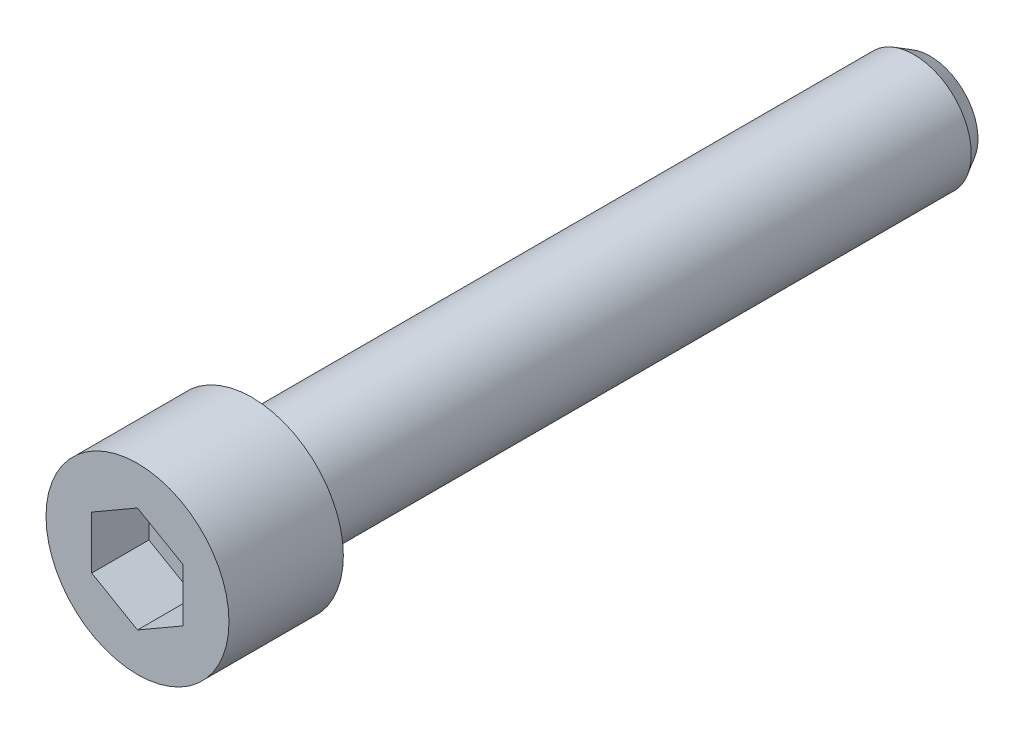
ISO-10303-21;
HEADER;
FILE_DESCRIPTION(('STEP AP214'),'2;1');
FILE_NAME('part.step','',(''),(''),'','','');
FILE_SCHEMA(('AUTOMOTIVE_DESIGN { 1 0 10303 214 1 1 1 1 }'));
ENDSEC;
DATA;
#1=APPLICATION_CONTEXT('core data for automotive mechanical design processes');
#2=APPLICATION_PROTOCOL_DEFINITION('international standard','automotive_design',2000,#1);
#3=PRODUCT_CONTEXT('',#1,'mechanical');
#4=PRODUCT('Part','Part','',(#3));
#5=PRODUCT_RELATED_PRODUCT_CATEGORY('part','',(#4));
#6=PRODUCT_DEFINITION_FORMATION('','',#4);
#7=PRODUCT_DEFINITION_CONTEXT('part definition',#1,'design');
#8=PRODUCT_DEFINITION('design','',#6,#7);
#9=PRODUCT_DEFINITION_SHAPE('','',#8);
#10=(LENGTH_UNIT() NAMED_UNIT(*) SI_UNIT(.MILLI.,.METRE.));
#11=(NAMED_UNIT(*) PLANE_ANGLE_UNIT() SI_UNIT($,.RADIAN.));
#12=(NAMED_UNIT(*) SI_UNIT($,.STERADIAN.) SOLID_ANGLE_UNIT());
#13=UNCERTAINTY_MEASURE_WITH_UNIT(LENGTH_MEASURE(1.E-05),#10,'distance_accuracy_value','');
#14=(GEOMETRIC_REPRESENTATION_CONTEXT(3) GLOBAL_UNCERTAINTY_ASSIGNED_CONTEXT((#13)) GLOBAL_UNIT_ASSIGNED_CONTEXT((#10,
#11,#12)) REPRESENTATION_CONTEXT('',''));
#15=CARTESIAN_POINT('',(0.,0.,0.));
#16=DIRECTION('',(0.,0.,1.));
#17=DIRECTION('',(1.,0.,0.));
#18=AXIS2_PLACEMENT_3D('',#15,#16,#17);
#19=CARTESIAN_POINT('',(0.,0.,1.8));
#20=DIRECTION('',(0.,0.,-1.));
#21=DIRECTION('',(1.,0.,0.));
#22=AXIS2_PLACEMENT_3D('',#19,#20,#21);
#23=SPHERICAL_SURFACE('',#22,3.5);
#24=CARTESIAN_POINT('',(0.,0.,0.7));
#25=DIRECTION('',(0.,0.,-1.));
#26=DIRECTION('',(1.,0.,0.));
#27=AXIS2_PLACEMENT_3D('',#24,#25,#26);
#28=CIRCLE('',#27,3.32264954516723);
#29=CARTESIAN_POINT('',(3.32264954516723,0.,0.7));
#30=VERTEX_POINT('',#29);
#31=EDGE_CURVE('E9',#30,#30,#28,.T.);
#32=CARTESIAN_POINT('',(0.,0.,0.));
#33=DIRECTION('',(0.,0.,-1.));
#34=DIRECTION('',(1.,0.,0.));
#35=AXIS2_PLACEMENT_3D('',#32,#33,#34);
#36=CIRCLE('',#35,3.00166620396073);
#37=CARTESIAN_POINT('',(3.00166620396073,0.,0.));
#38=VERTEX_POINT('',#37);
#39=EDGE_CURVE('E17',#38,#38,#36,.F.);
#40=CARTESIAN_POINT('',(3.32264954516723,0.,0.7));
#41=CARTESIAN_POINT('',(3.32012332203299,0.,0.692369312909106));
#42=CARTESIAN_POINT('',(3.31757081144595,0.,0.68474732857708));
#43=CARTESIAN_POINT('',(3.31241333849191,0.,0.669521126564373));
#44=CARTESIAN_POINT('',(3.30980837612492,0.,0.661916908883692));
#45=CARTESIAN_POINT('',(3.30454612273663,0.,0.646726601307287));
#46=CARTESIAN_POINT('',(3.30188883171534,0.,0.639140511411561));
#47=CARTESIAN_POINT('',(3.29652204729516,0.,0.623986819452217));
#48=CARTESIAN_POINT('',(3.29381255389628,0.,0.616419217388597));
#49=CARTESIAN_POINT('',(3.28834149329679,0.,0.601302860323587));
#50=CARTESIAN_POINT('',(3.28557992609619,0.,0.593754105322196));
#51=CARTESIAN_POINT('',(3.28000484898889,0.,0.578675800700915));
#52=CARTESIAN_POINT('',(3.27719133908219,0.,0.571146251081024));
#53=CARTESIAN_POINT('',(3.27151251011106,0.,0.556106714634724));
#54=CARTESIAN_POINT('',(3.26864719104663,0.,0.548596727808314));
#55=CARTESIAN_POINT('',(3.26286487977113,0.,0.533596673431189));
#56=CARTESIAN_POINT('',(3.25994788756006,0.,0.526106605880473));
#57=CARTESIAN_POINT('',(3.25406236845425,0.,0.511146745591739));
#58=CARTESIAN_POINT('',(3.25109384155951,0.,0.503676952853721));
#59=CARTESIAN_POINT('',(3.24510539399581,0.,0.488757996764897));
#60=CARTESIAN_POINT('',(3.24208547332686,0.,0.481308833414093));
#61=CARTESIAN_POINT('',(3.23599438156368,0.,0.466431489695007));
#62=CARTESIAN_POINT('',(3.23292321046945,0.,0.459003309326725));
#63=CARTESIAN_POINT('',(3.22672976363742,0.,0.444168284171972));
#64=CARTESIAN_POINT('',(3.22360748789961,0.,0.436761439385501));
#65=CARTESIAN_POINT('',(3.21731197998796,0.,0.421969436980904));
#66=CARTESIAN_POINT('',(3.2141387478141,0.,0.414584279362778));
#67=CARTESIAN_POINT('',(3.20774147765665,0.,0.399836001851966));
#68=CARTESIAN_POINT('',(3.20451743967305,0.,0.39247288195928));
#69=CARTESIAN_POINT('',(3.19801871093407,0.,0.377769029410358));
#70=CARTESIAN_POINT('',(3.19474402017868,0.,0.370428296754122));
#71=CARTESIAN_POINT('',(3.18814414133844,0.,0.35576956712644));
#72=CARTESIAN_POINT('',(3.18481895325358,0.,0.348451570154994));
#73=CARTESIAN_POINT('',(3.17811823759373,0.,0.333838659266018));
#74=CARTESIAN_POINT('',(3.17474271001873,0.,0.326543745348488));
#75=CARTESIAN_POINT('',(3.16794147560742,0.,0.311977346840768));
#76=CARTESIAN_POINT('',(3.1645157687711,0.,0.304705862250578));
#77=CARTESIAN_POINT('',(3.15761433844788,0.,0.290186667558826));
#78=CARTESIAN_POINT('',(3.15413861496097,0.,0.282938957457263));
#79=CARTESIAN_POINT('',(3.14713731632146,0.,0.268467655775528));
#80=CARTESIAN_POINT('',(3.14361174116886,0.,0.261244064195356));
#81=CARTESIAN_POINT('',(3.13651090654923,0.,0.246821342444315));
#82=CARTESIAN_POINT('',(3.1329356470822,0.,0.239622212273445));
#83=CARTESIAN_POINT('',(3.12573561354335,0.,0.225248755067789));
#84=CARTESIAN_POINT('',(3.12211083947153,0.,0.218074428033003));
#85=CARTESIAN_POINT('',(3.11481194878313,0.,0.203750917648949));
#86=CARTESIAN_POINT('',(3.11113783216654,0.,0.196601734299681));
#87=CARTESIAN_POINT('',(3.10374043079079,0.,0.182328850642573));
#88=CARTESIAN_POINT('',(3.10001714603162,0.,0.175205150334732));
#89=CARTESIAN_POINT('',(3.09252158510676,0.,0.1609835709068));
#90=CARTESIAN_POINT('',(3.08874930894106,0.,0.153885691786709));
#91=CARTESIAN_POINT('',(3.08115594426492,0.,0.139716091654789));
#92=CARTESIAN_POINT('',(3.07733485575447,0.,0.13264437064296));
#93=CARTESIAN_POINT('',(3.06964404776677,0.,0.118527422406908));
#94=CARTESIAN_POINT('',(3.06577432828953,0.,0.111482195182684));
#95=CARTESIAN_POINT('',(3.05798644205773,0.,0.0974185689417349));
#96=CARTESIAN_POINT('',(3.05406827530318,0.,0.0904001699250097));
#97=CARTESIAN_POINT('',(3.04618368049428,0.,0.0763905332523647));
#98=CARTESIAN_POINT('',(3.04221725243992,0.,0.0693992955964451));
#99=CARTESIAN_POINT('',(3.03423632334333,0.,0.0554443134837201));
#100=CARTESIAN_POINT('',(3.03022182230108,0.,0.0484805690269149));
#101=CARTESIAN_POINT('',(3.02214493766,0.,0.0345809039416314));
#102=CARTESIAN_POINT('',(3.01808255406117,0.,0.0276449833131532));
#103=CARTESIAN_POINT('',(3.00991009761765,0.,0.0138012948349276));
#104=CARTESIAN_POINT('',(3.00580002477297,0.,0.00689352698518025));
#105=CARTESIAN_POINT('',(3.00166620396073,0.,0.));
#106=B_SPLINE_CURVE_WITH_KNOTS('',3,(#40,#41,#42,#43,#44,#45,#46,#47,#48,#49,#50,#51,#52,#53,
#54,#55,#56,#57,#58,#59,#60,#61,#62,#63,#64,#65,#66,#67,#68,#69,#70,#71,#72,#73,#74,#75,#76,#77,
#78,#79,#80,#81,#82,#83,#84,#85,#86,#87,#88,#89,#90,#91,#92,#93,#94,#95,#96,#97,#98,#99,#100,
#101,#102,#103,#104,#105),.UNSPECIFIED.,.F.,.F.,(4,2,2,2,2,2,2,2,2,2,2,2,2,2,2,2,2,2,2,2,2,2,2,
2,2,2,2,2,2,2,2,2,4),(0.,0.0241139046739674,0.048227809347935,0.0723417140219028,
0.0964556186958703,0.120569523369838,0.144683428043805,0.168797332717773,0.192911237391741,
0.217025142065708,0.241139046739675,0.265252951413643,0.289366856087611,0.313480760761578,
0.337594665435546,0.361708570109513,0.385822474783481,0.409936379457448,0.434050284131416,
0.458164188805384,0.482278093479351,0.506391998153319,0.530505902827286,0.554619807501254,
0.578733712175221,0.602847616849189,0.626961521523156,0.651075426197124,0.675189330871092,
0.699303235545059,0.723417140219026,0.747531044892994,0.771644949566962),.UNSPECIFIED.);
#107=EDGE_CURVE('BSEAM14',#30,#38,#106,.T.);
#108=ORIENTED_EDGE('',*,*,#31,.T.);
#109=ORIENTED_EDGE('',*,*,#39,.T.);
#110=ORIENTED_EDGE('',*,*,#107,.T.);
#111=ORIENTED_EDGE('',*,*,#107,.F.);
#112=EDGE_LOOP('',(#108,#110,#109,#111));
#113=FACE_BOUND('',#112,.T.);
#114=ADVANCED_FACE('F14',(#113),#23,.T.);
#115=CARTESIAN_POINT('',(4.19170962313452,0.,0.7));
#116=DIRECTION('',(0.,0.,1.));
#117=DIRECTION('',(-1.,0.,0.));
#118=AXIS2_PLACEMENT_3D('',#115,#116,#117);
#119=PLANE('',#118);
#120=ORIENTED_EDGE('',*,*,#31,.F.);
#121=EDGE_LOOP('',(#120));
#122=FACE_BOUND('',#121,.T.);
#123=CARTESIAN_POINT('',(0.,0.,0.7));
#124=DIRECTION('',(0.,0.,-1.));
#125=DIRECTION('',(1.,0.,0.));
#126=AXIS2_PLACEMENT_3D('',#123,#124,#125);
#127=CIRCLE('',#126,4.19170962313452);
#128=CARTESIAN_POINT('',(4.19170962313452,0.,0.7));
#129=VERTEX_POINT('',#128);
#130=EDGE_CURVE('E22',#129,#129,#127,.T.);
#131=ORIENTED_EDGE('',*,*,#130,.T.);
#132=EDGE_LOOP('',(#131));
#133=FACE_BOUND('',#132,.T.);
#134=ADVANCED_FACE('F137',(#122,#133),#119,.F.);
#135=CARTESIAN_POINT('',(0.,0.,2.1));
#136=DIRECTION('',(0.,0.,1.));
#137=DIRECTION('',(-1.,0.,0.));
#138=AXIS2_PLACEMENT_3D('',#135,#136,#137);
#139=CONICAL_SURFACE('',#138,5.,0.5235987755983);
#140=ORIENTED_EDGE('',*,*,#130,.F.);
#141=EDGE_LOOP('',(#140));
#142=FACE_BOUND('',#141,.T.);
#143=CARTESIAN_POINT('',(0.,0.,2.1));
#144=DIRECTION('',(0.,0.,-1.));
#145=DIRECTION('',(1.,0.,0.));
#146=AXIS2_PLACEMENT_3D('',#143,#144,#145);
#147=CIRCLE('',#146,5.);
#148=CARTESIAN_POINT('',(5.,0.,2.1));
#149=VERTEX_POINT('',#148);
#150=EDGE_CURVE('E131',#149,#149,#147,.T.);
#151=ORIENTED_EDGE('',*,*,#150,.T.);
#152=EDGE_LOOP('',(#151));
#153=FACE_BOUND('',#152,.T.);
#154=ADVANCED_FACE('F139',(#142,#153),#139,.T.);
#155=CARTESIAN_POINT('',(0.,0.,10.));
#156=DIRECTION('',(0.,0.,-1.));
#157=DIRECTION('',(1.,0.,0.));
#158=AXIS2_PLACEMENT_3D('',#155,#156,#157);
#159=CYLINDRICAL_SURFACE('',#158,5.);
#160=CARTESIAN_POINT('',(0.,0.,60.));
#161=DIRECTION('',(0.,0.,-1.));
#162=DIRECTION('',(1.,0.,0.));
#163=AXIS2_PLACEMENT_3D('',#160,#161,#162);
#164=CIRCLE('',#163,5.);
#165=CARTESIAN_POINT('',(5.,0.,60.));
#166=VERTEX_POINT('',#165);
#167=EDGE_CURVE('E128',#166,#166,#164,.T.);
#168=ORIENTED_EDGE('',*,*,#167,.T.);
#169=EDGE_LOOP('',(#168));
#170=FACE_BOUND('',#169,.T.);
#171=ORIENTED_EDGE('',*,*,#150,.F.);
#172=EDGE_LOOP('',(#171));
#173=FACE_BOUND('',#172,.T.);
#174=ADVANCED_FACE('F142',(#170,#173),#159,.T.);
#175=CARTESIAN_POINT('',(5.,0.,60.));
#176=DIRECTION('',(0.,0.,-1.));
#177=DIRECTION('',(1.,0.,0.));
#178=AXIS2_PLACEMENT_3D('',#175,#176,#177);
#179=PLANE('',#178);
#180=CARTESIAN_POINT('',(0.,0.,60.));
#181=DIRECTION('',(0.,0.,-1.));
#182=DIRECTION('',(1.,0.,0.));
#183=AXIS2_PLACEMENT_3D('',#180,#181,#182);
#184=CIRCLE('',#183,8.);
#185=CARTESIAN_POINT('',(8.,0.,60.));
#186=VERTEX_POINT('',#185);
#187=EDGE_CURVE('E125',#186,#186,#184,.T.);
#188=ORIENTED_EDGE('',*,*,#187,.T.);
#189=EDGE_LOOP('',(#188));
#190=FACE_BOUND('',#189,.T.);
#191=ORIENTED_EDGE('',*,*,#167,.F.);
#192=EDGE_LOOP('',(#191));
#193=FACE_BOUND('',#192,.T.);
#194=ADVANCED_FACE('F147',(#190,#193),#179,.T.);
#195=CARTESIAN_POINT('',(0.,0.,10.));
#196=DIRECTION('',(0.,0.,-1.));
#197=DIRECTION('',(1.,0.,0.));
#198=AXIS2_PLACEMENT_3D('',#195,#196,#197);
#199=CYLINDRICAL_SURFACE('',#198,8.);
#200=CARTESIAN_POINT('',(0.,0.,70.));
#201=DIRECTION('',(0.,0.,-1.));
#202=DIRECTION('',(1.,0.,0.));
#203=AXIS2_PLACEMENT_3D('',#200,#201,#202);
#204=CIRCLE('',#203,8.);
#205=CARTESIAN_POINT('',(8.,0.,70.));
#206=VERTEX_POINT('',#205);
#207=EDGE_CURVE('E122',#206,#206,#204,.T.);
#208=ORIENTED_EDGE('',*,*,#207,.T.);
#209=EDGE_LOOP('',(#208));
#210=FACE_BOUND('',#209,.T.);
#211=ORIENTED_EDGE('',*,*,#187,.F.);
#212=EDGE_LOOP('',(#211));
#213=FACE_BOUND('',#212,.T.);
#214=ADVANCED_FACE('F154',(#210,#213),#199,.T.);
#215=CARTESIAN_POINT('',(8.,0.,70.));
#216=DIRECTION('',(0.,0.,1.));
#217=DIRECTION('',(-1.,0.,0.));
#218=AXIS2_PLACEMENT_3D('',#215,#216,#217);
#219=PLANE('',#218);
#220=DIRECTION('',(-0.86602540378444,0.5,0.));
#221=VECTOR('',#220,1.);
#222=CARTESIAN_POINT('',(4.,2.30940107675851,70.));
#223=LINE('',#222,#221);
#224=CARTESIAN_POINT('',(4.,2.30940107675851,70.));
#225=VERTEX_POINT('',#224);
#226=CARTESIAN_POINT('',(0.,4.618802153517,70.));
#227=VERTEX_POINT('',#226);
#228=EDGE_CURVE('E29',#225,#227,#223,.T.);
#229=ORIENTED_EDGE('',*,*,#228,.F.);
#230=DIRECTION('',(0.,1.,0.));
#231=VECTOR('',#230,1.);
#232=CARTESIAN_POINT('',(4.,-2.30940107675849,70.));
#233=LINE('',#232,#231);
#234=CARTESIAN_POINT('',(4.,-2.30940107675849,70.));
#235=VERTEX_POINT('',#234);
#236=EDGE_CURVE('E98',#235,#225,#233,.T.);
#237=ORIENTED_EDGE('',*,*,#236,.F.);
#238=DIRECTION('',(-0.866025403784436,-0.5,0.));
#239=VECTOR('',#238,1.);
#240=CARTESIAN_POINT('',(4.,-2.30940107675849,70.));
#241=LINE('',#240,#239);
#242=CARTESIAN_POINT('',(0.,-4.61880215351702,70.));
#243=VERTEX_POINT('',#242);
#244=EDGE_CURVE('E93',#235,#243,#241,.T.);
#245=ORIENTED_EDGE('',*,*,#244,.T.);
#246=DIRECTION('',(0.866025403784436,-0.5,0.));
#247=VECTOR('',#246,1.);
#248=CARTESIAN_POINT('',(-4.,-2.30940107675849,70.));
#249=LINE('',#248,#247);
#250=CARTESIAN_POINT('',(-4.,-2.30940107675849,70.));
#251=VERTEX_POINT('',#250);
#252=EDGE_CURVE('E91',#251,#243,#249,.T.);
#253=ORIENTED_EDGE('',*,*,#252,.F.);
#254=DIRECTION('',(0.,1.,0.));
#255=VECTOR('',#254,1.);
#256=CARTESIAN_POINT('',(-4.,-2.30940107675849,70.));
#257=LINE('',#256,#255);
#258=CARTESIAN_POINT('',(-4.,2.30940107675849,70.));
#259=VERTEX_POINT('',#258);
#260=EDGE_CURVE('E72',#251,#259,#257,.T.);
#261=ORIENTED_EDGE('',*,*,#260,.T.);
#262=DIRECTION('',(0.866025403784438,0.5,0.));
#263=VECTOR('',#262,1.);
#264=CARTESIAN_POINT('',(-4.,2.30940107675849,70.));
#265=LINE('',#264,#263);
#266=EDGE_CURVE('E83',#259,#227,#265,.T.);
#267=ORIENTED_EDGE('',*,*,#266,.T.);
#268=EDGE_LOOP('',(#229,#237,#245,#253,#261,#267));
#269=FACE_BOUND('',#268,.T.);
#270=ORIENTED_EDGE('',*,*,#207,.F.);
#271=EDGE_LOOP('',(#270));
#272=FACE_BOUND('',#271,.T.);
#273=ADVANCED_FACE('F87',(#269,#272),#219,.T.);
#274=CARTESIAN_POINT('',(4.,2.30940107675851,65.));
#275=DIRECTION('',(0.5,0.86602540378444,0.));
#276=DIRECTION('',(0.86602540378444,-0.5,0.));
#277=AXIS2_PLACEMENT_3D('',#274,#275,#276);
#278=PLANE('',#277);
#279=DIRECTION('',(0.,0.,1.));
#280=VECTOR('',#279,1.);
#281=CARTESIAN_POINT('',(4.,2.30940107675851,65.));
#282=LINE('',#281,#280);
#283=CARTESIAN_POINT('',(4.,2.30940107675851,65.));
#284=VERTEX_POINT('',#283);
#285=EDGE_CURVE('E36',#284,#225,#282,.T.);
#286=ORIENTED_EDGE('',*,*,#285,.T.);
#287=ORIENTED_EDGE('',*,*,#228,.T.);
#288=DIRECTION('',(0.,0.,1.));
#289=VECTOR('',#288,1.);
#290=CARTESIAN_POINT('',(0.,4.618802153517,65.));
#291=LINE('',#290,#289);
#292=CARTESIAN_POINT('',(0.,4.618802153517,65.));
#293=VERTEX_POINT('',#292);
#294=EDGE_CURVE('E80',#293,#227,#291,.T.);
#295=ORIENTED_EDGE('',*,*,#294,.F.);
#296=DIRECTION('',(-0.86602540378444,0.5,0.));
#297=VECTOR('',#296,1.);
#298=CARTESIAN_POINT('',(4.,2.30940107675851,65.));
#299=LINE('',#298,#297);
#300=EDGE_CURVE('E100',#284,#293,#299,.T.);
#301=ORIENTED_EDGE('',*,*,#300,.F.);
#302=EDGE_LOOP('',(#286,#287,#295,#301));
#303=FACE_BOUND('',#302,.T.);
#304=ADVANCED_FACE('F185',(#303),#278,.F.);
#305=CARTESIAN_POINT('',(4.,-2.30940107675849,65.));
#306=DIRECTION('',(1.,0.,0.));
#307=DIRECTION('',(0.,-1.,0.));
#308=AXIS2_PLACEMENT_3D('',#305,#306,#307);
#309=PLANE('',#308);
#310=DIRECTION('',(0.,0.,1.));
#311=VECTOR('',#310,1.);
#312=CARTESIAN_POINT('',(4.,-2.30940107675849,65.));
#313=LINE('',#312,#311);
#314=CARTESIAN_POINT('',(4.,-2.30940107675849,65.));
#315=VERTEX_POINT('',#314);
#316=EDGE_CURVE('E119',#315,#235,#313,.T.);
#317=ORIENTED_EDGE('',*,*,#316,.T.);
#318=ORIENTED_EDGE('',*,*,#236,.T.);
#319=ORIENTED_EDGE('',*,*,#285,.F.);
#320=DIRECTION('',(0.,1.,0.));
#321=VECTOR('',#320,1.);
#322=CARTESIAN_POINT('',(4.,-2.30940107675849,65.));
#323=LINE('',#322,#321);
#324=EDGE_CURVE('E112',#315,#284,#323,.T.);
#325=ORIENTED_EDGE('',*,*,#324,.F.);
#326=EDGE_LOOP('',(#317,#318,#319,#325));
#327=FACE_BOUND('',#326,.T.);
#328=ADVANCED_FACE('F193',(#327),#309,.F.);
#329=CARTESIAN_POINT('',(4.,-2.30940107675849,65.));
#330=DIRECTION('',(-0.5,0.866025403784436,0.));
#331=DIRECTION('',(0.866025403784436,0.5,0.));
#332=AXIS2_PLACEMENT_3D('',#329,#330,#331);
#333=PLANE('',#332);
#334=DIRECTION('',(0.,0.,1.));
#335=VECTOR('',#334,1.);
#336=CARTESIAN_POINT('',(0.,-4.61880215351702,65.));
#337=LINE('',#336,#335);
#338=CARTESIAN_POINT('',(0.,-4.61880215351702,65.));
#339=VERTEX_POINT('',#338);
#340=EDGE_CURVE('E117',#339,#243,#337,.T.);
#341=ORIENTED_EDGE('',*,*,#340,.T.);
#342=ORIENTED_EDGE('',*,*,#244,.F.);
#343=ORIENTED_EDGE('',*,*,#316,.F.);
#344=DIRECTION('',(-0.866025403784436,-0.5,0.));
#345=VECTOR('',#344,1.);
#346=CARTESIAN_POINT('',(4.,-2.30940107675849,65.));
#347=LINE('',#346,#345);
#348=EDGE_CURVE('E109',#315,#339,#347,.T.);
#349=ORIENTED_EDGE('',*,*,#348,.T.);
#350=EDGE_LOOP('',(#341,#342,#343,#349));
#351=FACE_BOUND('',#350,.T.);
#352=ADVANCED_FACE('F189',(#351),#333,.T.);
#353=CARTESIAN_POINT('',(-4.,-2.30940107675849,65.));
#354=DIRECTION('',(-0.5,-0.866025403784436,0.));
#355=DIRECTION('',(-0.866025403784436,0.5,0.));
#356=AXIS2_PLACEMENT_3D('',#353,#354,#355);
#357=PLANE('',#356);
#358=DIRECTION('',(0.,0.,1.));
#359=VECTOR('',#358,1.);
#360=CARTESIAN_POINT('',(-4.,-2.30940107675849,65.));
#361=LINE('',#360,#359);
#362=CARTESIAN_POINT('',(-4.,-2.30940107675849,65.));
#363=VERTEX_POINT('',#362);
#364=EDGE_CURVE('E79',#363,#251,#361,.T.);
#365=ORIENTED_EDGE('',*,*,#364,.T.);
#366=ORIENTED_EDGE('',*,*,#252,.T.);
#367=ORIENTED_EDGE('',*,*,#340,.F.);
#368=DIRECTION('',(0.866025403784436,-0.5,0.));
#369=VECTOR('',#368,1.);
#370=CARTESIAN_POINT('',(-4.,-2.30940107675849,65.));
#371=LINE('',#370,#369);
#372=EDGE_CURVE('E106',#363,#339,#371,.T.);
#373=ORIENTED_EDGE('',*,*,#372,.F.);
#374=EDGE_LOOP('',(#365,#366,#367,#373));
#375=FACE_BOUND('',#374,.T.);
#376=ADVANCED_FACE('F182',(#375),#357,.F.);
#377=CARTESIAN_POINT('',(-4.,-2.30940107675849,65.));
#378=DIRECTION('',(1.,0.,0.));
#379=DIRECTION('',(0.,-1.,0.));
#380=AXIS2_PLACEMENT_3D('',#377,#378,#379);
#381=PLANE('',#380);
#382=DIRECTION('',(0.,0.,1.));
#383=VECTOR('',#382,1.);
#384=CARTESIAN_POINT('',(-4.,2.30940107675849,65.));
#385=LINE('',#384,#383);
#386=CARTESIAN_POINT('',(-4.,2.30940107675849,65.));
#387=VERTEX_POINT('',#386);
#388=EDGE_CURVE('E68',#387,#259,#385,.T.);
#389=ORIENTED_EDGE('',*,*,#388,.T.);
#390=ORIENTED_EDGE('',*,*,#260,.F.);
#391=ORIENTED_EDGE('',*,*,#364,.F.);
#392=DIRECTION('',(0.,1.,0.));
#393=VECTOR('',#392,1.);
#394=CARTESIAN_POINT('',(-4.,-2.30940107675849,65.));
#395=LINE('',#394,#393);
#396=EDGE_CURVE('E75',#363,#387,#395,.T.);
#397=ORIENTED_EDGE('',*,*,#396,.T.);
#398=EDGE_LOOP('',(#389,#390,#391,#397));
#399=FACE_BOUND('',#398,.T.);
#400=ADVANCED_FACE('F70',(#399),#381,.T.);
#401=CARTESIAN_POINT('',(-4.,2.30940107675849,65.));
#402=DIRECTION('',(0.5,-0.866025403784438,0.));
#403=DIRECTION('',(-0.866025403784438,-0.5,0.));
#404=AXIS2_PLACEMENT_3D('',#401,#402,#403);
#405=PLANE('',#404);
#406=DIRECTION('',(0.866025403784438,0.5,0.));
#407=VECTOR('',#406,1.);
#408=CARTESIAN_POINT('',(-4.,2.30940107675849,65.));
#409=LINE('',#408,#407);
#410=EDGE_CURVE('E103',#387,#293,#409,.T.);
#411=ORIENTED_EDGE('',*,*,#410,.T.);
#412=ORIENTED_EDGE('',*,*,#294,.T.);
#413=ORIENTED_EDGE('',*,*,#266,.F.);
#414=ORIENTED_EDGE('',*,*,#388,.F.);
#415=EDGE_LOOP('',(#411,#412,#413,#414));
#416=FACE_BOUND('',#415,.T.);
#417=ADVANCED_FACE('F84',(#416),#405,.T.);
#418=CARTESIAN_POINT('',(8.,0.,65.));
#419=DIRECTION('',(0.,0.,1.));
#420=DIRECTION('',(-1.,0.,0.));
#421=AXIS2_PLACEMENT_3D('',#418,#419,#420);
#422=PLANE('',#421);
#423=ORIENTED_EDGE('',*,*,#300,.T.);
#424=ORIENTED_EDGE('',*,*,#410,.F.);
#425=ORIENTED_EDGE('',*,*,#396,.F.);
#426=ORIENTED_EDGE('',*,*,#372,.T.);
#427=ORIENTED_EDGE('',*,*,#348,.F.);
#428=ORIENTED_EDGE('',*,*,#324,.T.);
#429=EDGE_LOOP('',(#423,#424,#425,#426,#427,#428));
#430=FACE_BOUND('',#429,.T.);
#431=ADVANCED_FACE('F170',(#430),#422,.T.);
#432=CARTESIAN_POINT('',(0.,0.,0.));
#433=DIRECTION('',(0.,0.,-1.));
#434=DIRECTION('',(1.,0.,0.));
#435=AXIS2_PLACEMENT_3D('',#432,#433,#434);
#436=PLANE('',#435);
#437=ORIENTED_EDGE('',*,*,#39,.F.);
#438=EDGE_LOOP('',(#437));
#439=FACE_BOUND('',#438,.T.);
#440=ADVANCED_FACE('F168',(#439),#436,.T.);
#441=CLOSED_SHELL('',(#114,#134,#154,#174,#194,#214,#273,#304,#328,#352,#376,#400,#417,#431,#440));
#442=MANIFOLD_SOLID_BREP('B1',#441);
#443=ADVANCED_BREP_SHAPE_REPRESENTATION('',(#18,#442),#14);
#444=SHAPE_DEFINITION_REPRESENTATION(#9,#443);
ENDSEC;
END-ISO-10303-21;
